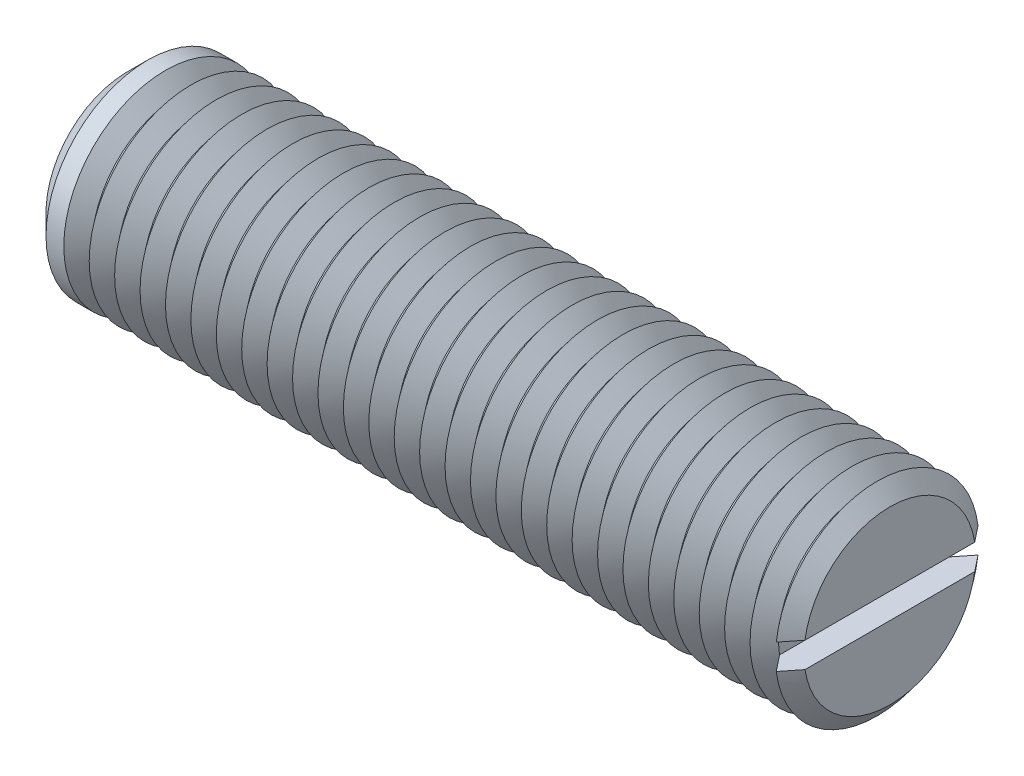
from build123d import *

# Parameters (mm, degrees)
SKETCH1_R       = 8
EXTRUDE1_DEPTH  = 30
SKETCH2_W       = 2
SKETCH2_H       = 2
EXTRUDE2_DEPTH  = 12
CHAMFER1_SIZE   = 1.6
LPATTERN1_COUNT = 29
LPATTERN1_PITCH = 2


with BuildPart() as part:
    # Sketch1 → Extrude1 (new, symmetric)
    with BuildSketch(Plane(origin=(0, 0, 0), x_dir=(0, 0, -1), z_dir=(1, 0, 0))):
        Circle(SKETCH1_R)
    extrude(amount=EXTRUDE1_DEPTH, both=True)

    # Sketch2 → Extrude2 (cut, symmetric)
    with BuildSketch(Plane.XY):
        with Locations((29, 0)):
            Rectangle(SKETCH2_W, SKETCH2_H)
    extrude(amount=EXTRUDE2_DEPTH, both=True, mode=Mode.SUBTRACT)

    # Chamfer1
    chamfer1_edges = [part.edges().sort_by_distance(p)[0] for p in [
        (-30, 0, 8),
    ]]
    chamfer(chamfer1_edges, length=CHAMFER1_SIZE)

    # Sketch3 → Cut-Revolve1 (revolve, cut)
    with BuildSketch(Plane.XY, mode=Mode.PRIVATE) as cut_revolve1_sk:
        Polygon((29, -8), (31, -8), (30, -6.7510004), align=None)
    cut_revolve1 = revolve(cut_revolve1_sk.sketch.rotate(Axis((0, 0, 0), (1, 0, 0)), 277.180755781), axis=Axis((0, 0, 0), (1, 0, 0)), mode=Mode.SUBTRACT)

    # LPattern1: Cut-Revolve1 ×29
    with Locations(*[(-i * LPATTERN1_PITCH, 0, 0) for i in range(1, LPATTERN1_COUNT)]):
        add(cut_revolve1, mode=Mode.SUBTRACT)


solid = part.part
